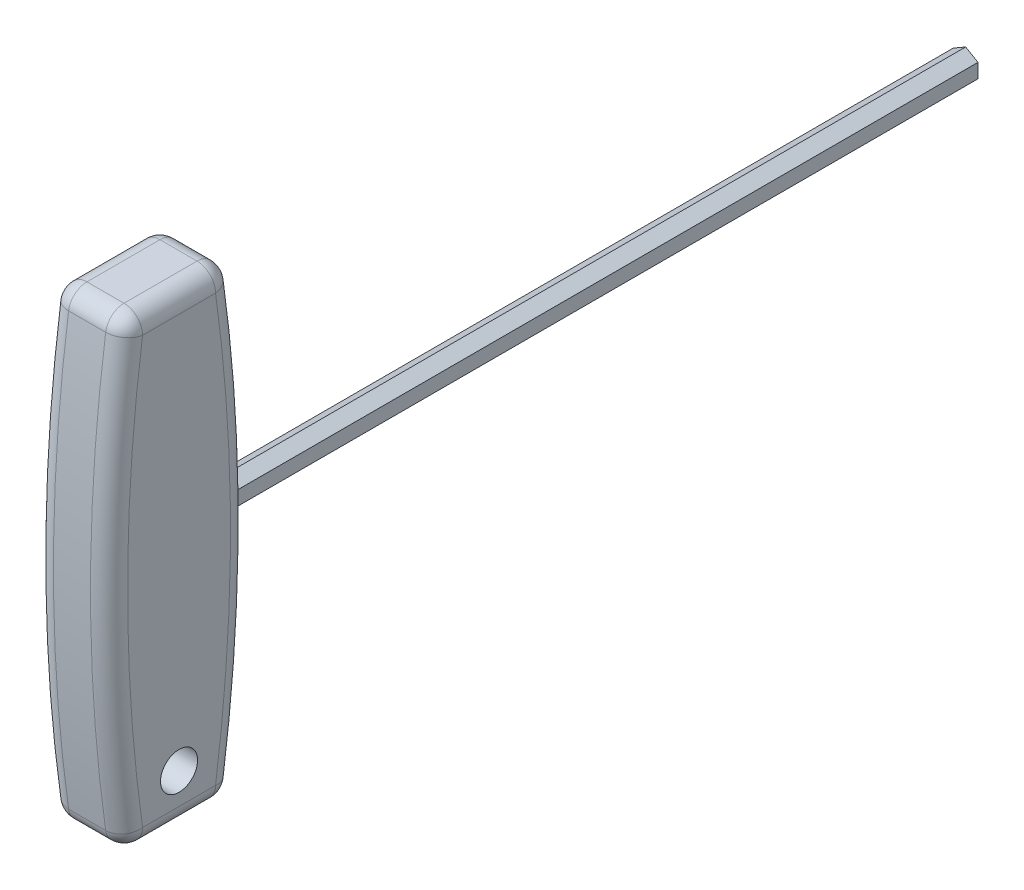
ISO-10303-21;
HEADER;
FILE_DESCRIPTION(('STEP AP214'),'2;1');
FILE_NAME('part.step','',(''),(''),'','','');
FILE_SCHEMA(('AUTOMOTIVE_DESIGN { 1 0 10303 214 1 1 1 1 }'));
ENDSEC;
DATA;
#1=APPLICATION_CONTEXT('core data for automotive mechanical design processes');
#2=APPLICATION_PROTOCOL_DEFINITION('international standard','automotive_design',2000,#1);
#3=PRODUCT_CONTEXT('',#1,'mechanical');
#4=PRODUCT('Part','Part','',(#3));
#5=PRODUCT_RELATED_PRODUCT_CATEGORY('part','',(#4));
#6=PRODUCT_DEFINITION_FORMATION('','',#4);
#7=PRODUCT_DEFINITION_CONTEXT('part definition',#1,'design');
#8=PRODUCT_DEFINITION('design','',#6,#7);
#9=PRODUCT_DEFINITION_SHAPE('','',#8);
#10=(LENGTH_UNIT() NAMED_UNIT(*) SI_UNIT(.MILLI.,.METRE.));
#11=(NAMED_UNIT(*) PLANE_ANGLE_UNIT() SI_UNIT($,.RADIAN.));
#12=(NAMED_UNIT(*) SI_UNIT($,.STERADIAN.) SOLID_ANGLE_UNIT());
#13=UNCERTAINTY_MEASURE_WITH_UNIT(LENGTH_MEASURE(1.E-05),#10,'distance_accuracy_value','');
#14=(GEOMETRIC_REPRESENTATION_CONTEXT(3) GLOBAL_UNCERTAINTY_ASSIGNED_CONTEXT((#13)) GLOBAL_UNIT_ASSIGNED_CONTEXT((#10,
#11,#12)) REPRESENTATION_CONTEXT('',''));
#15=CARTESIAN_POINT('',(0.,0.,0.));
#16=DIRECTION('',(0.,0.,1.));
#17=DIRECTION('',(1.,0.,0.));
#18=AXIS2_PLACEMENT_3D('',#15,#16,#17);
#19=CARTESIAN_POINT('',(0.,0.,0.));
#20=DIRECTION('',(0.,0.,1.));
#21=DIRECTION('',(1.,0.,0.));
#22=AXIS2_PLACEMENT_3D('',#19,#20,#21);
#23=PLANE('',#22);
#24=DIRECTION('',(-0.866025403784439,-0.5,0.));
#25=VECTOR('',#24,1.);
#26=CARTESIAN_POINT('',(-2.,1.15470053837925,0.));
#27=LINE('',#26,#25);
#28=CARTESIAN_POINT('',(0.,2.3094010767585,0.));
#29=VERTEX_POINT('',#28);
#30=CARTESIAN_POINT('',(-2.,1.15470053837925,0.));
#31=VERTEX_POINT('',#30);
#32=EDGE_CURVE('E144',#29,#31,#27,.T.);
#33=ORIENTED_EDGE('',*,*,#32,.F.);
#34=DIRECTION('',(-0.866025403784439,0.5,0.));
#35=VECTOR('',#34,1.);
#36=CARTESIAN_POINT('',(0.,2.3094010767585,0.));
#37=LINE('',#36,#35);
#38=CARTESIAN_POINT('',(2.,1.15470053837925,0.));
#39=VERTEX_POINT('',#38);
#40=EDGE_CURVE('E314',#39,#29,#37,.T.);
#41=ORIENTED_EDGE('',*,*,#40,.F.);
#42=DIRECTION('',(0.,1.,0.));
#43=VECTOR('',#42,1.);
#44=CARTESIAN_POINT('',(2.,1.15470053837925,0.));
#45=LINE('',#44,#43);
#46=CARTESIAN_POINT('',(2.,-1.15470053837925,0.));
#47=VERTEX_POINT('',#46);
#48=EDGE_CURVE('E315',#47,#39,#45,.T.);
#49=ORIENTED_EDGE('',*,*,#48,.F.);
#50=DIRECTION('',(0.866025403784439,0.5,0.));
#51=VECTOR('',#50,1.);
#52=CARTESIAN_POINT('',(2.,-1.15470053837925,0.));
#53=LINE('',#52,#51);
#54=CARTESIAN_POINT('',(0.,-2.3094010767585,0.));
#55=VERTEX_POINT('',#54);
#56=EDGE_CURVE('E320',#55,#47,#53,.T.);
#57=ORIENTED_EDGE('',*,*,#56,.F.);
#58=DIRECTION('',(0.866025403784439,-0.5,0.));
#59=VECTOR('',#58,1.);
#60=CARTESIAN_POINT('',(0.,-2.3094010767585,0.));
#61=LINE('',#60,#59);
#62=CARTESIAN_POINT('',(-2.,-1.15470053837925,0.));
#63=VERTEX_POINT('',#62);
#64=EDGE_CURVE('E324',#63,#55,#61,.T.);
#65=ORIENTED_EDGE('',*,*,#64,.F.);
#66=DIRECTION('',(0.,1.,0.));
#67=VECTOR('',#66,1.);
#68=CARTESIAN_POINT('',(-2.,-1.15470053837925,0.));
#69=LINE('',#68,#67);
#70=EDGE_CURVE('E147',#31,#63,#69,.F.);
#71=ORIENTED_EDGE('',*,*,#70,.F.);
#72=EDGE_LOOP('',(#33,#41,#49,#57,#65,#71));
#73=FACE_BOUND('',#72,.T.);
#74=ADVANCED_FACE('F15',(#73),#23,.F.);
#75=CARTESIAN_POINT('',(-3.,-34.4999999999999,127.410508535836));
#76=DIRECTION('',(1.,0.,0.));
#77=DIRECTION('',(0.,1.,0.));
#78=AXIS2_PLACEMENT_3D('',#75,#76,#77);
#79=SPHERICAL_SURFACE('',#78,3.);
#80=CARTESIAN_POINT('',(-3.,-34.4999999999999,127.410508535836));
#81=DIRECTION('',(-1.,0.,0.));
#82=DIRECTION('',(0.,0.,1.));
#83=AXIS2_PLACEMENT_3D('',#80,#81,#82);
#84=CIRCLE('',#83,3.);
#85=CARTESIAN_POINT('',(-3.,-37.4999999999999,127.410508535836));
#86=VERTEX_POINT('',#85);
#87=CARTESIAN_POINT('',(-3.,-34.9190102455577,124.439914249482));
#88=VERTEX_POINT('',#87);
#89=EDGE_CURVE('E326',#86,#88,#84,.F.);
#90=ORIENTED_EDGE('',*,*,#89,.F.);
#91=CARTESIAN_POINT('',(-3.,-34.4999999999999,127.410508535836));
#92=DIRECTION('',(0.,0.,-1.));
#93=DIRECTION('',(-1.,0.,0.));
#94=AXIS2_PLACEMENT_3D('',#91,#92,#93);
#95=CIRCLE('',#94,3.);
#96=CARTESIAN_POINT('',(-6.,-34.5,127.410508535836));
#97=VERTEX_POINT('',#96);
#98=EDGE_CURVE('E292',#97,#86,#95,.F.);
#99=ORIENTED_EDGE('',*,*,#98,.F.);
#100=CARTESIAN_POINT('',(-3.,-34.5000000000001,127.410508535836));
#101=DIRECTION('',(0.,0.990198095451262,-0.139670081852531));
#102=DIRECTION('',(0.,-0.139670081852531,-0.990198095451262));
#103=AXIS2_PLACEMENT_3D('',#100,#101,#102);
#104=CIRCLE('',#103,3.);
#105=EDGE_CURVE('E258',#88,#97,#104,.T.);
#106=ORIENTED_EDGE('',*,*,#105,.F.);
#107=EDGE_LOOP('',(#90,#99,#106));
#108=FACE_BOUND('',#107,.T.);
#109=ADVANCED_FACE('F356',(#108),#79,.T.);
#110=CARTESIAN_POINT('',(-3.,34.5,127.410508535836));
#111=DIRECTION('',(1.,0.,0.));
#112=DIRECTION('',(0.,1.,0.));
#113=AXIS2_PLACEMENT_3D('',#110,#111,#112);
#114=SPHERICAL_SURFACE('',#113,3.00000000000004);
#115=CARTESIAN_POINT('',(-3.,34.5,127.410508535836));
#116=DIRECTION('',(1.,0.,0.));
#117=DIRECTION('',(0.,0.,-1.));
#118=AXIS2_PLACEMENT_3D('',#115,#116,#117);
#119=CIRCLE('',#118,3.);
#120=CARTESIAN_POINT('',(-3.,34.9190102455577,124.439914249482));
#121=VERTEX_POINT('',#120);
#122=CARTESIAN_POINT('',(-3.,37.5000000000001,127.410508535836));
#123=VERTEX_POINT('',#122);
#124=EDGE_CURVE('E300',#121,#123,#119,.T.);
#125=ORIENTED_EDGE('',*,*,#124,.F.);
#126=CARTESIAN_POINT('',(-3.,34.5000000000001,127.410508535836));
#127=DIRECTION('',(0.,0.990198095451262,0.13967008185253));
#128=DIRECTION('',(0.,0.13967008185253,-0.990198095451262));
#129=AXIS2_PLACEMENT_3D('',#126,#127,#128);
#130=CIRCLE('',#129,3.);
#131=CARTESIAN_POINT('',(-6.,34.5000000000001,127.410508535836));
#132=VERTEX_POINT('',#131);
#133=EDGE_CURVE('E282',#132,#121,#130,.F.);
#134=ORIENTED_EDGE('',*,*,#133,.F.);
#135=CARTESIAN_POINT('',(-3.,34.5000000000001,127.410508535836));
#136=DIRECTION('',(0.,0.,1.));
#137=DIRECTION('',(1.,0.,0.));
#138=AXIS2_PLACEMENT_3D('',#135,#136,#137);
#139=CIRCLE('',#138,3.);
#140=EDGE_CURVE('E248',#123,#132,#139,.T.);
#141=ORIENTED_EDGE('',*,*,#140,.F.);
#142=EDGE_LOOP('',(#125,#134,#141));
#143=FACE_BOUND('',#142,.T.);
#144=ADVANCED_FACE('F353',(#143),#114,.T.);
#145=CARTESIAN_POINT('',(-3.,-34.4999999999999,139.224916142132));
#146=DIRECTION('',(1.,0.,0.));
#147=DIRECTION('',(0.,1.,0.));
#148=AXIS2_PLACEMENT_3D('',#145,#146,#147);
#149=SPHERICAL_SURFACE('',#148,3.00000000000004);
#150=CARTESIAN_POINT('',(-3.,-34.4999999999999,139.224916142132));
#151=DIRECTION('',(1.,0.,0.));
#152=DIRECTION('',(0.,0.,-1.));
#153=AXIS2_PLACEMENT_3D('',#150,#151,#152);
#154=CIRCLE('',#153,3.);
#155=CARTESIAN_POINT('',(-3.,-34.9190102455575,142.195510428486));
#156=VERTEX_POINT('',#155);
#157=CARTESIAN_POINT('',(-3.,-37.4999999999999,139.224916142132));
#158=VERTEX_POINT('',#157);
#159=EDGE_CURVE('E329',#156,#158,#154,.T.);
#160=ORIENTED_EDGE('',*,*,#159,.F.);
#161=CARTESIAN_POINT('',(-3.,-34.4999999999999,139.224916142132));
#162=DIRECTION('',(0.,-0.990198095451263,-0.13967008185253));
#163=DIRECTION('',(0.,-0.13967008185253,0.990198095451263));
#164=AXIS2_PLACEMENT_3D('',#161,#162,#163);
#165=CIRCLE('',#164,3.);
#166=CARTESIAN_POINT('',(-6.,-34.4999999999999,139.224916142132));
#167=VERTEX_POINT('',#166);
#168=EDGE_CURVE('E243',#167,#156,#165,.F.);
#169=ORIENTED_EDGE('',*,*,#168,.F.);
#170=CARTESIAN_POINT('',(-3.,-34.4999999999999,139.224916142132));
#171=DIRECTION('',(0.,0.,-1.));
#172=DIRECTION('',(-1.,0.,0.));
#173=AXIS2_PLACEMENT_3D('',#170,#171,#172);
#174=CIRCLE('',#173,3.);
#175=EDGE_CURVE('E287',#158,#167,#174,.T.);
#176=ORIENTED_EDGE('',*,*,#175,.F.);
#177=EDGE_LOOP('',(#160,#169,#176));
#178=FACE_BOUND('',#177,.T.);
#179=ADVANCED_FACE('F348',(#178),#149,.T.);
#180=CARTESIAN_POINT('',(-3.,34.5000000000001,139.224916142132));
#181=DIRECTION('',(1.,0.,0.));
#182=DIRECTION('',(0.,1.,0.));
#183=AXIS2_PLACEMENT_3D('',#180,#181,#182);
#184=SPHERICAL_SURFACE('',#183,3.);
#185=CARTESIAN_POINT('',(-3.,34.5000000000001,139.224916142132));
#186=DIRECTION('',(1.,0.,0.));
#187=DIRECTION('',(0.,0.,-1.));
#188=AXIS2_PLACEMENT_3D('',#185,#186,#187);
#189=CIRCLE('',#188,3.);
#190=CARTESIAN_POINT('',(-3.,37.5000000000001,139.224916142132));
#191=VERTEX_POINT('',#190);
#192=CARTESIAN_POINT('',(-3.,34.9190102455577,142.195510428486));
#193=VERTEX_POINT('',#192);
#194=EDGE_CURVE('E297',#191,#193,#189,.T.);
#195=ORIENTED_EDGE('',*,*,#194,.F.);
#196=CARTESIAN_POINT('',(-3.,34.5000000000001,139.224916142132));
#197=DIRECTION('',(0.,0.,1.));
#198=DIRECTION('',(1.,0.,0.));
#199=AXIS2_PLACEMENT_3D('',#196,#197,#198);
#200=CIRCLE('',#199,3.);
#201=CARTESIAN_POINT('',(-6.,34.5000000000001,139.224916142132));
#202=VERTEX_POINT('',#201);
#203=EDGE_CURVE('E253',#202,#191,#200,.F.);
#204=ORIENTED_EDGE('',*,*,#203,.F.);
#205=CARTESIAN_POINT('',(-3.,34.5000000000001,139.224916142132));
#206=DIRECTION('',(0.,-0.990198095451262,0.13967008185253));
#207=DIRECTION('',(0.,0.13967008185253,0.990198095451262));
#208=AXIS2_PLACEMENT_3D('',#205,#206,#207);
#209=CIRCLE('',#208,3.);
#210=EDGE_CURVE('E221',#193,#202,#209,.T.);
#211=ORIENTED_EDGE('',*,*,#210,.F.);
#212=EDGE_LOOP('',(#195,#204,#211));
#213=FACE_BOUND('',#212,.T.);
#214=ADVANCED_FACE('F343',(#213),#184,.T.);
#215=CARTESIAN_POINT('',(0.,-34.4999999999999,139.224916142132));
#216=DIRECTION('',(1.,0.,0.));
#217=DIRECTION('',(0.,0.,-1.));
#218=AXIS2_PLACEMENT_3D('',#215,#216,#217);
#219=CYLINDRICAL_SURFACE('',#218,3.);
#220=ORIENTED_EDGE('',*,*,#159,.T.);
#221=DIRECTION('',(1.,0.,0.));
#222=VECTOR('',#221,1.);
#223=CARTESIAN_POINT('',(0.,-37.4999999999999,139.224916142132));
#224=LINE('',#223,#222);
#225=CARTESIAN_POINT('',(3.,-37.4999999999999,139.224916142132));
#226=VERTEX_POINT('',#225);
#227=EDGE_CURVE('E204',#226,#158,#224,.F.);
#228=ORIENTED_EDGE('',*,*,#227,.F.);
#229=CARTESIAN_POINT('',(3.,-34.4999999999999,139.224916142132));
#230=DIRECTION('',(1.,0.,0.));
#231=DIRECTION('',(0.,1.,0.));
#232=AXIS2_PLACEMENT_3D('',#229,#230,#231);
#233=CIRCLE('',#232,3.);
#234=CARTESIAN_POINT('',(3.,-34.9190102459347,142.195510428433));
#235=VERTEX_POINT('',#234);
#236=EDGE_CURVE('E206',#235,#226,#233,.T.);
#237=ORIENTED_EDGE('',*,*,#236,.F.);
#238=DIRECTION('',(1.,0.,0.));
#239=VECTOR('',#238,1.);
#240=CARTESIAN_POINT('',(0.,-34.9190102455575,142.195510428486));
#241=LINE('',#240,#239);
#242=EDGE_CURVE('E209',#156,#235,#241,.T.);
#243=ORIENTED_EDGE('',*,*,#242,.F.);
#244=EDGE_LOOP('',(#220,#228,#237,#243));
#245=FACE_BOUND('',#244,.T.);
#246=ADVANCED_FACE('F347',(#245),#219,.T.);
#247=CARTESIAN_POINT('',(0.,-34.4999999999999,127.410508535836));
#248=DIRECTION('',(-1.,0.,0.));
#249=DIRECTION('',(0.,0.,1.));
#250=AXIS2_PLACEMENT_3D('',#247,#248,#249);
#251=CYLINDRICAL_SURFACE('',#250,3.);
#252=CARTESIAN_POINT('',(3.,-34.4999999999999,127.410508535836));
#253=DIRECTION('',(1.,0.,0.));
#254=DIRECTION('',(0.,1.,0.));
#255=AXIS2_PLACEMENT_3D('',#252,#253,#254);
#256=CIRCLE('',#255,3.);
#257=CARTESIAN_POINT('',(3.,-37.4999999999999,127.410508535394));
#258=VERTEX_POINT('',#257);
#259=CARTESIAN_POINT('',(3.,-34.9190102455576,124.439914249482));
#260=VERTEX_POINT('',#259);
#261=EDGE_CURVE('E179',#258,#260,#256,.T.);
#262=ORIENTED_EDGE('',*,*,#261,.F.);
#263=DIRECTION('',(1.,0.,0.));
#264=VECTOR('',#263,1.);
#265=CARTESIAN_POINT('',(0.,-37.4999999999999,127.410508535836));
#266=LINE('',#265,#264);
#267=EDGE_CURVE('E333',#86,#258,#266,.T.);
#268=ORIENTED_EDGE('',*,*,#267,.F.);
#269=ORIENTED_EDGE('',*,*,#89,.T.);
#270=DIRECTION('',(1.,0.,0.));
#271=VECTOR('',#270,1.);
#272=CARTESIAN_POINT('',(0.,-34.9190102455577,124.439914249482));
#273=LINE('',#272,#271);
#274=EDGE_CURVE('E171',#260,#88,#273,.F.);
#275=ORIENTED_EDGE('',*,*,#274,.F.);
#276=EDGE_LOOP('',(#262,#268,#269,#275));
#277=FACE_BOUND('',#276,.T.);
#278=ADVANCED_FACE('F596',(#277),#251,.T.);
#279=CARTESIAN_POINT('',(-2.,1.15470053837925,0.));
#280=DIRECTION('',(-0.5,0.866025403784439,0.));
#281=DIRECTION('',(-0.866025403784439,-0.5,0.));
#282=AXIS2_PLACEMENT_3D('',#279,#280,#281);
#283=PLANE('',#282);
#284=ORIENTED_EDGE('',*,*,#32,.T.);
#285=DIRECTION('',(0.,0.,1.));
#286=VECTOR('',#285,1.);
#287=CARTESIAN_POINT('',(-2.,1.15470053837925,0.));
#288=LINE('',#287,#286);
#289=CARTESIAN_POINT('',(-2.,1.15470053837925,121.992000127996));
#290=VERTEX_POINT('',#289);
#291=EDGE_CURVE('E141',#290,#31,#288,.F.);
#292=ORIENTED_EDGE('',*,*,#291,.F.);
#293=CARTESIAN_POINT('',(-4.,0.,372.));
#294=DIRECTION('',(-0.5,0.866025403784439,0.));
#295=DIRECTION('',(0.866025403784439,0.5,0.));
#296=AXIS2_PLACEMENT_3D('',#293,#294,#295);
#297=ELLIPSE('',#296,500.021332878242,250.010666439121);
#298=CARTESIAN_POINT('',(0.,2.3094010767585,122.));
#299=VERTEX_POINT('',#298);
#300=EDGE_CURVE('E18',#299,#290,#297,.T.);
#301=ORIENTED_EDGE('',*,*,#300,.F.);
#302=DIRECTION('',(0.,0.,1.));
#303=VECTOR('',#302,1.);
#304=CARTESIAN_POINT('',(0.,2.3094010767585,0.));
#305=LINE('',#304,#303);
#306=EDGE_CURVE('E303',#29,#299,#305,.T.);
#307=ORIENTED_EDGE('',*,*,#306,.F.);
#308=EDGE_LOOP('',(#284,#292,#301,#307));
#309=FACE_BOUND('',#308,.T.);
#310=ADVANCED_FACE('F143',(#309),#283,.T.);
#311=CARTESIAN_POINT('',(-2.,-1.15470053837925,0.));
#312=DIRECTION('',(-1.,0.,0.));
#313=DIRECTION('',(0.,0.,1.));
#314=AXIS2_PLACEMENT_3D('',#311,#312,#313);
#315=PLANE('',#314);
#316=ORIENTED_EDGE('',*,*,#70,.T.);
#317=DIRECTION('',(0.,0.,1.));
#318=VECTOR('',#317,1.);
#319=CARTESIAN_POINT('',(-2.,-1.15470053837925,0.));
#320=LINE('',#319,#318);
#321=CARTESIAN_POINT('',(-2.,-1.15470053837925,121.992000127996));
#322=VERTEX_POINT('',#321);
#323=EDGE_CURVE('E153',#322,#63,#320,.F.);
#324=ORIENTED_EDGE('',*,*,#323,.F.);
#325=CARTESIAN_POINT('',(-2.,0.,372.));
#326=DIRECTION('',(1.,0.,0.));
#327=DIRECTION('',(0.,0.,-1.));
#328=AXIS2_PLACEMENT_3D('',#325,#326,#327);
#329=CIRCLE('',#328,250.010666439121);
#330=EDGE_CURVE('E150',#290,#322,#329,.F.);
#331=ORIENTED_EDGE('',*,*,#330,.F.);
#332=ORIENTED_EDGE('',*,*,#291,.T.);
#333=EDGE_LOOP('',(#316,#324,#331,#332));
#334=FACE_BOUND('',#333,.T.);
#335=ADVANCED_FACE('F151',(#334),#315,.T.);
#336=CARTESIAN_POINT('',(0.,-2.3094010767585,0.));
#337=DIRECTION('',(-0.5,-0.866025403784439,0.));
#338=DIRECTION('',(0.866025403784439,-0.5,0.));
#339=AXIS2_PLACEMENT_3D('',#336,#337,#338);
#340=PLANE('',#339);
#341=ORIENTED_EDGE('',*,*,#64,.T.);
#342=DIRECTION('',(0.,0.,1.));
#343=VECTOR('',#342,1.);
#344=CARTESIAN_POINT('',(0.,-2.3094010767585,0.));
#345=LINE('',#344,#343);
#346=CARTESIAN_POINT('',(0.,-2.3094010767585,122.));
#347=VERTEX_POINT('',#346);
#348=EDGE_CURVE('E321',#347,#55,#345,.F.);
#349=ORIENTED_EDGE('',*,*,#348,.F.);
#350=CARTESIAN_POINT('',(-4.,0.,372.));
#351=DIRECTION('',(-0.5,-0.866025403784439,0.));
#352=DIRECTION('',(0.866025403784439,-0.5,0.));
#353=AXIS2_PLACEMENT_3D('',#350,#351,#352);
#354=ELLIPSE('',#353,500.021332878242,250.010666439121);
#355=EDGE_CURVE('E157',#322,#347,#354,.T.);
#356=ORIENTED_EDGE('',*,*,#355,.F.);
#357=ORIENTED_EDGE('',*,*,#323,.T.);
#358=EDGE_LOOP('',(#341,#349,#356,#357));
#359=FACE_BOUND('',#358,.T.);
#360=ADVANCED_FACE('F383',(#359),#340,.T.);
#361=CARTESIAN_POINT('',(2.,-1.15470053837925,0.));
#362=DIRECTION('',(0.5,-0.866025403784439,0.));
#363=DIRECTION('',(0.866025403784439,0.5,0.));
#364=AXIS2_PLACEMENT_3D('',#361,#362,#363);
#365=PLANE('',#364);
#366=ORIENTED_EDGE('',*,*,#56,.T.);
#367=DIRECTION('',(0.,0.,-1.));
#368=VECTOR('',#367,1.);
#369=CARTESIAN_POINT('',(2.,-1.15470053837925,0.));
#370=LINE('',#369,#368);
#371=CARTESIAN_POINT('',(2.,-1.15470053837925,121.992000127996));
#372=VERTEX_POINT('',#371);
#373=EDGE_CURVE('E317',#372,#47,#370,.T.);
#374=ORIENTED_EDGE('',*,*,#373,.F.);
#375=CARTESIAN_POINT('',(4.,0.,372.));
#376=DIRECTION('',(0.5,-0.866025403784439,0.));
#377=DIRECTION('',(0.866025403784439,0.5,0.));
#378=AXIS2_PLACEMENT_3D('',#375,#376,#377);
#379=ELLIPSE('',#378,500.021332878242,250.010666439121);
#380=EDGE_CURVE('E378',#347,#372,#379,.T.);
#381=ORIENTED_EDGE('',*,*,#380,.F.);
#382=ORIENTED_EDGE('',*,*,#348,.T.);
#383=EDGE_LOOP('',(#366,#374,#381,#382));
#384=FACE_BOUND('',#383,.T.);
#385=ADVANCED_FACE('F387',(#384),#365,.T.);
#386=CARTESIAN_POINT('',(2.,1.15470053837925,0.));
#387=DIRECTION('',(1.,0.,0.));
#388=DIRECTION('',(0.,0.,-1.));
#389=AXIS2_PLACEMENT_3D('',#386,#387,#388);
#390=PLANE('',#389);
#391=ORIENTED_EDGE('',*,*,#48,.T.);
#392=DIRECTION('',(0.,0.,1.));
#393=VECTOR('',#392,1.);
#394=CARTESIAN_POINT('',(2.,1.15470053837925,0.));
#395=LINE('',#394,#393);
#396=CARTESIAN_POINT('',(2.,1.15470053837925,121.992000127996));
#397=VERTEX_POINT('',#396);
#398=EDGE_CURVE('E311',#397,#39,#395,.F.);
#399=ORIENTED_EDGE('',*,*,#398,.F.);
#400=CARTESIAN_POINT('',(2.,0.,372.));
#401=DIRECTION('',(1.,0.,0.));
#402=DIRECTION('',(0.,0.,-1.));
#403=AXIS2_PLACEMENT_3D('',#400,#401,#402);
#404=CIRCLE('',#403,250.010666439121);
#405=EDGE_CURVE('E376',#372,#397,#404,.T.);
#406=ORIENTED_EDGE('',*,*,#405,.F.);
#407=ORIENTED_EDGE('',*,*,#373,.T.);
#408=EDGE_LOOP('',(#391,#399,#406,#407));
#409=FACE_BOUND('',#408,.T.);
#410=ADVANCED_FACE('F391',(#409),#390,.T.);
#411=CARTESIAN_POINT('',(0.,2.3094010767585,0.));
#412=DIRECTION('',(0.5,0.866025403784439,0.));
#413=DIRECTION('',(-0.866025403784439,0.5,0.));
#414=AXIS2_PLACEMENT_3D('',#411,#412,#413);
#415=PLANE('',#414);
#416=ORIENTED_EDGE('',*,*,#40,.T.);
#417=ORIENTED_EDGE('',*,*,#306,.T.);
#418=CARTESIAN_POINT('',(4.,0.,372.));
#419=DIRECTION('',(0.5,0.866025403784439,0.));
#420=DIRECTION('',(0.866025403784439,-0.5,0.));
#421=AXIS2_PLACEMENT_3D('',#418,#419,#420);
#422=ELLIPSE('',#421,500.021332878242,250.010666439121);
#423=EDGE_CURVE('E163',#397,#299,#422,.T.);
#424=ORIENTED_EDGE('',*,*,#423,.F.);
#425=ORIENTED_EDGE('',*,*,#398,.T.);
#426=EDGE_LOOP('',(#416,#417,#424,#425));
#427=FACE_BOUND('',#426,.T.);
#428=ADVANCED_FACE('F394',(#427),#415,.T.);
#429=CARTESIAN_POINT('',(0.,34.5,127.410508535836));
#430=DIRECTION('',(1.,0.,0.));
#431=DIRECTION('',(0.,0.,-1.));
#432=AXIS2_PLACEMENT_3D('',#429,#430,#431);
#433=CYLINDRICAL_SURFACE('',#432,3.);
#434=ORIENTED_EDGE('',*,*,#124,.T.);
#435=DIRECTION('',(1.,0.,0.));
#436=VECTOR('',#435,1.);
#437=CARTESIAN_POINT('',(0.,37.5000000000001,127.410508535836));
#438=LINE('',#437,#436);
#439=CARTESIAN_POINT('',(3.,37.5000000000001,127.410508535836));
#440=VERTEX_POINT('',#439);
#441=EDGE_CURVE('E308',#440,#123,#438,.F.);
#442=ORIENTED_EDGE('',*,*,#441,.F.);
#443=CARTESIAN_POINT('',(3.,34.5,127.410508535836));
#444=DIRECTION('',(1.,0.,0.));
#445=DIRECTION('',(0.,1.,0.));
#446=AXIS2_PLACEMENT_3D('',#443,#444,#445);
#447=CIRCLE('',#446,3.);
#448=CARTESIAN_POINT('',(3.,34.9190102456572,124.439914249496));
#449=VERTEX_POINT('',#448);
#450=EDGE_CURVE('E375',#449,#440,#447,.T.);
#451=ORIENTED_EDGE('',*,*,#450,.F.);
#452=DIRECTION('',(1.,0.,0.));
#453=VECTOR('',#452,1.);
#454=CARTESIAN_POINT('',(0.,34.9190102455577,124.439914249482));
#455=LINE('',#454,#453);
#456=EDGE_CURVE('E164',#121,#449,#455,.T.);
#457=ORIENTED_EDGE('',*,*,#456,.F.);
#458=EDGE_LOOP('',(#434,#442,#451,#457));
#459=FACE_BOUND('',#458,.T.);
#460=ADVANCED_FACE('F580',(#459),#433,.T.);
#461=CARTESIAN_POINT('',(0.,34.5000000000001,139.224916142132));
#462=DIRECTION('',(1.,0.,0.));
#463=DIRECTION('',(0.,0.,-1.));
#464=AXIS2_PLACEMENT_3D('',#461,#462,#463);
#465=CYLINDRICAL_SURFACE('',#464,3.);
#466=ORIENTED_EDGE('',*,*,#194,.T.);
#467=DIRECTION('',(1.,0.,0.));
#468=VECTOR('',#467,1.);
#469=CARTESIAN_POINT('',(0.,34.9190102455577,142.195510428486));
#470=LINE('',#469,#468);
#471=CARTESIAN_POINT('',(3.,34.9190102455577,142.195510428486));
#472=VERTEX_POINT('',#471);
#473=EDGE_CURVE('E218',#472,#193,#470,.F.);
#474=ORIENTED_EDGE('',*,*,#473,.F.);
#475=CARTESIAN_POINT('',(3.,34.5000000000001,139.224916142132));
#476=DIRECTION('',(1.,0.,0.));
#477=DIRECTION('',(0.,1.,0.));
#478=AXIS2_PLACEMENT_3D('',#475,#476,#477);
#479=CIRCLE('',#478,3.);
#480=CARTESIAN_POINT('',(3.,37.5000000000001,139.224916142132));
#481=VERTEX_POINT('',#480);
#482=EDGE_CURVE('E307',#481,#472,#479,.T.);
#483=ORIENTED_EDGE('',*,*,#482,.F.);
#484=DIRECTION('',(1.,0.,0.));
#485=VECTOR('',#484,1.);
#486=CARTESIAN_POINT('',(0.,37.5000000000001,139.224916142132));
#487=LINE('',#486,#485);
#488=EDGE_CURVE('E569',#191,#481,#487,.T.);
#489=ORIENTED_EDGE('',*,*,#488,.F.);
#490=EDGE_LOOP('',(#466,#474,#483,#489));
#491=FACE_BOUND('',#490,.T.);
#492=ADVANCED_FACE('F584',(#491),#465,.T.);
#493=CARTESIAN_POINT('',(-3.,-34.4999999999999,129.067712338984));
#494=DIRECTION('',(0.,0.,-1.));
#495=DIRECTION('',(-1.,0.,0.));
#496=AXIS2_PLACEMENT_3D('',#493,#494,#495);
#497=CYLINDRICAL_SURFACE('',#496,3.);
#498=ORIENTED_EDGE('',*,*,#175,.T.);
#499=DIRECTION('',(0.,0.,-1.));
#500=VECTOR('',#499,1.);
#501=CARTESIAN_POINT('',(-6.,-34.4999999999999,133.317712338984));
#502=LINE('',#501,#500);
#503=EDGE_CURVE('E548',#167,#97,#502,.T.);
#504=ORIENTED_EDGE('',*,*,#503,.T.);
#505=ORIENTED_EDGE('',*,*,#98,.T.);
#506=DIRECTION('',(0.,0.,-1.));
#507=VECTOR('',#506,1.);
#508=CARTESIAN_POINT('',(-3.,-37.4999999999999,124.817712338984));
#509=LINE('',#508,#507);
#510=EDGE_CURVE('E330',#158,#86,#509,.T.);
#511=ORIENTED_EDGE('',*,*,#510,.F.);
#512=EDGE_LOOP('',(#498,#504,#505,#511));
#513=FACE_BOUND('',#512,.T.);
#514=ADVANCED_FACE('F269',(#513),#497,.T.);
#515=CARTESIAN_POINT('',(-3.,0.,372.));
#516=DIRECTION('',(1.,0.,0.));
#517=DIRECTION('',(0.,0.,-1.));
#518=AXIS2_PLACEMENT_3D('',#515,#516,#517);
#519=TOROIDAL_SURFACE('',#518,247.010666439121,3.);
#520=ORIENTED_EDGE('',*,*,#105,.T.);
#521=CARTESIAN_POINT('',(-6.,0.,372.));
#522=DIRECTION('',(1.,0.,0.));
#523=DIRECTION('',(0.,-0.139670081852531,-0.990198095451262));
#524=AXIS2_PLACEMENT_3D('',#521,#522,#523);
#525=CIRCLE('',#524,247.010666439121);
#526=EDGE_CURVE('E524',#97,#132,#525,.T.);
#527=ORIENTED_EDGE('',*,*,#526,.T.);
#528=ORIENTED_EDGE('',*,*,#133,.T.);
#529=CARTESIAN_POINT('',(-3.,0.,372.));
#530=DIRECTION('',(1.,0.,0.));
#531=DIRECTION('',(0.,0.,-1.));
#532=AXIS2_PLACEMENT_3D('',#529,#530,#531);
#533=CIRCLE('',#532,250.010666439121);
#534=EDGE_CURVE('E166',#88,#121,#533,.T.);
#535=ORIENTED_EDGE('',*,*,#534,.F.);
#536=EDGE_LOOP('',(#520,#527,#528,#535));
#537=FACE_BOUND('',#536,.T.);
#538=ADVANCED_FACE('F265',(#537),#519,.T.);
#539=CARTESIAN_POINT('',(-3.,34.5000000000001,137.567712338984));
#540=DIRECTION('',(0.,0.,1.));
#541=DIRECTION('',(1.,0.,0.));
#542=AXIS2_PLACEMENT_3D('',#539,#540,#541);
#543=CYLINDRICAL_SURFACE('',#542,3.);
#544=ORIENTED_EDGE('',*,*,#140,.T.);
#545=DIRECTION('',(0.,0.,-1.));
#546=VECTOR('',#545,1.);
#547=CARTESIAN_POINT('',(-6.,34.5000000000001,133.317712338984));
#548=LINE('',#547,#546);
#549=EDGE_CURVE('E538',#132,#202,#548,.F.);
#550=ORIENTED_EDGE('',*,*,#549,.T.);
#551=ORIENTED_EDGE('',*,*,#203,.T.);
#552=DIRECTION('',(0.,0.,1.));
#553=VECTOR('',#552,1.);
#554=CARTESIAN_POINT('',(-3.,37.5000000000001,141.817712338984));
#555=LINE('',#554,#553);
#556=EDGE_CURVE('E304',#123,#191,#555,.T.);
#557=ORIENTED_EDGE('',*,*,#556,.F.);
#558=EDGE_LOOP('',(#544,#550,#551,#557));
#559=FACE_BOUND('',#558,.T.);
#560=ADVANCED_FACE('F230',(#559),#543,.T.);
#561=CARTESIAN_POINT('',(-3.,0.,-105.364575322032));
#562=DIRECTION('',(1.,0.,0.));
#563=DIRECTION('',(0.,0.,-1.));
#564=AXIS2_PLACEMENT_3D('',#561,#562,#563);
#565=TOROIDAL_SURFACE('',#564,247.010666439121,3.);
#566=ORIENTED_EDGE('',*,*,#210,.T.);
#567=CARTESIAN_POINT('',(-6.,0.,-105.364575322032));
#568=DIRECTION('',(1.,0.,0.));
#569=DIRECTION('',(0.,0.13967008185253,0.990198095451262));
#570=AXIS2_PLACEMENT_3D('',#567,#568,#569);
#571=CIRCLE('',#570,247.010666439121);
#572=EDGE_CURVE('E516',#202,#167,#571,.T.);
#573=ORIENTED_EDGE('',*,*,#572,.T.);
#574=ORIENTED_EDGE('',*,*,#168,.T.);
#575=CARTESIAN_POINT('',(-3.,0.,-105.364575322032));
#576=DIRECTION('',(1.,0.,0.));
#577=DIRECTION('',(0.,0.,-1.));
#578=AXIS2_PLACEMENT_3D('',#575,#576,#577);
#579=CIRCLE('',#578,250.010666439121);
#580=EDGE_CURVE('E217',#193,#156,#579,.T.);
#581=ORIENTED_EDGE('',*,*,#580,.F.);
#582=EDGE_LOOP('',(#566,#573,#574,#581));
#583=FACE_BOUND('',#582,.T.);
#584=ADVANCED_FACE('F226',(#583),#565,.T.);
#585=CARTESIAN_POINT('',(0.,0.,-105.364575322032));
#586=DIRECTION('',(1.,0.,0.));
#587=DIRECTION('',(0.,0.,-1.));
#588=AXIS2_PLACEMENT_3D('',#585,#586,#587);
#589=CYLINDRICAL_SURFACE('',#588,250.010666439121);
#590=ORIENTED_EDGE('',*,*,#580,.T.);
#591=ORIENTED_EDGE('',*,*,#242,.T.);
#592=CARTESIAN_POINT('',(3.,0.,-105.364575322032));
#593=DIRECTION('',(-1.,0.,0.));
#594=DIRECTION('',(0.,0.,1.));
#595=AXIS2_PLACEMENT_3D('',#592,#593,#594);
#596=CIRCLE('',#595,250.010666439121);
#597=EDGE_CURVE('E210',#472,#235,#596,.F.);
#598=ORIENTED_EDGE('',*,*,#597,.F.);
#599=ORIENTED_EDGE('',*,*,#473,.T.);
#600=EDGE_LOOP('',(#590,#591,#598,#599));
#601=FACE_BOUND('',#600,.T.);
#602=ADVANCED_FACE('F198',(#601),#589,.T.);
#603=CARTESIAN_POINT('',(3.,-34.4999999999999,139.224916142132));
#604=DIRECTION('',(1.,0.,0.));
#605=DIRECTION('',(0.,1.,0.));
#606=AXIS2_PLACEMENT_3D('',#603,#604,#605);
#607=SPHERICAL_SURFACE('',#606,3.);
#608=CARTESIAN_POINT('',(3.,-34.5000000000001,139.224916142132));
#609=DIRECTION('',(0.,0.990198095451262,0.139670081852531));
#610=DIRECTION('',(0.,-0.139670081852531,0.990198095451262));
#611=AXIS2_PLACEMENT_3D('',#608,#609,#610);
#612=CIRCLE('',#611,3.);
#613=CARTESIAN_POINT('',(6.,-34.5,139.224916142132));
#614=VERTEX_POINT('',#613);
#615=EDGE_CURVE('E213',#235,#614,#612,.T.);
#616=ORIENTED_EDGE('',*,*,#615,.F.);
#617=ORIENTED_EDGE('',*,*,#236,.T.);
#618=CARTESIAN_POINT('',(3.,-34.4999999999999,139.224916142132));
#619=DIRECTION('',(0.,0.,1.));
#620=DIRECTION('',(1.,0.,0.));
#621=AXIS2_PLACEMENT_3D('',#618,#619,#620);
#622=CIRCLE('',#621,3.);
#623=EDGE_CURVE('E480',#614,#226,#622,.F.);
#624=ORIENTED_EDGE('',*,*,#623,.F.);
#625=EDGE_LOOP('',(#616,#617,#624));
#626=FACE_BOUND('',#625,.T.);
#627=ADVANCED_FACE('F193',(#626),#607,.T.);
#628=CARTESIAN_POINT('',(0.,-37.4999999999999,124.817712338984));
#629=DIRECTION('',(0.,-1.,0.));
#630=DIRECTION('',(0.,0.,-1.));
#631=AXIS2_PLACEMENT_3D('',#628,#629,#630);
#632=PLANE('',#631);
#633=ORIENTED_EDGE('',*,*,#267,.T.);
#634=DIRECTION('',(0.,0.,1.));
#635=VECTOR('',#634,1.);
#636=CARTESIAN_POINT('',(3.,-37.4999999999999,129.067712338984));
#637=LINE('',#636,#635);
#638=EDGE_CURVE('E483',#226,#258,#637,.F.);
#639=ORIENTED_EDGE('',*,*,#638,.F.);
#640=ORIENTED_EDGE('',*,*,#227,.T.);
#641=ORIENTED_EDGE('',*,*,#510,.T.);
#642=EDGE_LOOP('',(#633,#639,#640,#641));
#643=FACE_BOUND('',#642,.T.);
#644=ADVANCED_FACE('F188',(#643),#632,.T.);
#645=CARTESIAN_POINT('',(3.,-34.4999999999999,127.410508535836));
#646=DIRECTION('',(1.,0.,0.));
#647=DIRECTION('',(0.,1.,0.));
#648=AXIS2_PLACEMENT_3D('',#645,#646,#647);
#649=SPHERICAL_SURFACE('',#648,3.);
#650=CARTESIAN_POINT('',(3.,-34.4999999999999,127.410508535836));
#651=DIRECTION('',(0.,0.,1.));
#652=DIRECTION('',(1.,0.,0.));
#653=AXIS2_PLACEMENT_3D('',#650,#651,#652);
#654=CIRCLE('',#653,3.);
#655=CARTESIAN_POINT('',(6.,-34.4999999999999,127.410508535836));
#656=VERTEX_POINT('',#655);
#657=EDGE_CURVE('E477',#258,#656,#654,.T.);
#658=ORIENTED_EDGE('',*,*,#657,.F.);
#659=ORIENTED_EDGE('',*,*,#261,.T.);
#660=CARTESIAN_POINT('',(3.,-34.4999999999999,127.410508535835));
#661=DIRECTION('',(0.,-0.990198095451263,0.13967008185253));
#662=DIRECTION('',(0.,-0.13967008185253,-0.990198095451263));
#663=AXIS2_PLACEMENT_3D('',#660,#661,#662);
#664=CIRCLE('',#663,3.);
#665=EDGE_CURVE('E474',#656,#260,#664,.F.);
#666=ORIENTED_EDGE('',*,*,#665,.F.);
#667=EDGE_LOOP('',(#658,#659,#666));
#668=FACE_BOUND('',#667,.T.);
#669=ADVANCED_FACE('F184',(#668),#649,.T.);
#670=CARTESIAN_POINT('',(0.,0.,372.));
#671=DIRECTION('',(1.,0.,0.));
#672=DIRECTION('',(0.,0.,-1.));
#673=AXIS2_PLACEMENT_3D('',#670,#671,#672);
#674=CYLINDRICAL_SURFACE('',#673,250.010666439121);
#675=ORIENTED_EDGE('',*,*,#405,.T.);
#676=ORIENTED_EDGE('',*,*,#423,.T.);
#677=ORIENTED_EDGE('',*,*,#300,.T.);
#678=ORIENTED_EDGE('',*,*,#330,.T.);
#679=ORIENTED_EDGE('',*,*,#355,.T.);
#680=ORIENTED_EDGE('',*,*,#380,.T.);
#681=EDGE_LOOP('',(#675,#676,#677,#678,#679,#680));
#682=FACE_BOUND('',#681,.T.);
#683=ORIENTED_EDGE('',*,*,#456,.T.);
#684=CARTESIAN_POINT('',(3.,0.,372.));
#685=DIRECTION('',(-1.,0.,0.));
#686=DIRECTION('',(0.,0.,1.));
#687=AXIS2_PLACEMENT_3D('',#684,#685,#686);
#688=CIRCLE('',#687,250.010666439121);
#689=EDGE_CURVE('E175',#260,#449,#688,.F.);
#690=ORIENTED_EDGE('',*,*,#689,.F.);
#691=ORIENTED_EDGE('',*,*,#274,.T.);
#692=ORIENTED_EDGE('',*,*,#534,.T.);
#693=EDGE_LOOP('',(#683,#690,#691,#692));
#694=FACE_BOUND('',#693,.T.);
#695=ADVANCED_FACE('F160',(#682,#694),#674,.T.);
#696=CARTESIAN_POINT('',(3.,34.5,127.410508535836));
#697=DIRECTION('',(1.,0.,0.));
#698=DIRECTION('',(0.,1.,0.));
#699=AXIS2_PLACEMENT_3D('',#696,#697,#698);
#700=SPHERICAL_SURFACE('',#699,3.);
#701=CARTESIAN_POINT('',(3.,34.5000000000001,127.410508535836));
#702=DIRECTION('',(0.,0.,-1.));
#703=DIRECTION('',(-1.,0.,0.));
#704=AXIS2_PLACEMENT_3D('',#701,#702,#703);
#705=CIRCLE('',#704,3.);
#706=CARTESIAN_POINT('',(6.,34.5000000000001,127.410508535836));
#707=VERTEX_POINT('',#706);
#708=EDGE_CURVE('E33',#707,#440,#705,.F.);
#709=ORIENTED_EDGE('',*,*,#708,.F.);
#710=CARTESIAN_POINT('',(3.,34.5000000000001,127.410508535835));
#711=DIRECTION('',(0.,-0.990198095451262,-0.13967008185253));
#712=DIRECTION('',(0.,0.13967008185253,-0.990198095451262));
#713=AXIS2_PLACEMENT_3D('',#710,#711,#712);
#714=CIRCLE('',#713,3.);
#715=EDGE_CURVE('E444',#449,#707,#714,.T.);
#716=ORIENTED_EDGE('',*,*,#715,.F.);
#717=ORIENTED_EDGE('',*,*,#450,.T.);
#718=EDGE_LOOP('',(#709,#716,#717));
#719=FACE_BOUND('',#718,.T.);
#720=ADVANCED_FACE('F562',(#719),#700,.T.);
#721=CARTESIAN_POINT('',(0.,37.5000000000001,141.817712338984));
#722=DIRECTION('',(0.,1.,0.));
#723=DIRECTION('',(0.,0.,1.));
#724=AXIS2_PLACEMENT_3D('',#721,#722,#723);
#725=PLANE('',#724);
#726=ORIENTED_EDGE('',*,*,#441,.T.);
#727=ORIENTED_EDGE('',*,*,#556,.T.);
#728=ORIENTED_EDGE('',*,*,#488,.T.);
#729=DIRECTION('',(0.,0.,-1.));
#730=VECTOR('',#729,1.);
#731=CARTESIAN_POINT('',(3.,37.5000000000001,137.567712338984));
#732=LINE('',#731,#730);
#733=EDGE_CURVE('E443',#440,#481,#732,.F.);
#734=ORIENTED_EDGE('',*,*,#733,.F.);
#735=EDGE_LOOP('',(#726,#727,#728,#734));
#736=FACE_BOUND('',#735,.T.);
#737=ADVANCED_FACE('F559',(#736),#725,.T.);
#738=CARTESIAN_POINT('',(3.,34.5000000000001,139.224916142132));
#739=DIRECTION('',(1.,0.,0.));
#740=DIRECTION('',(0.,1.,0.));
#741=AXIS2_PLACEMENT_3D('',#738,#739,#740);
#742=SPHERICAL_SURFACE('',#741,3.);
#743=CARTESIAN_POINT('',(3.,34.5,139.224916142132));
#744=DIRECTION('',(0.,0.990198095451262,-0.13967008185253));
#745=DIRECTION('',(0.,0.13967008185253,0.990198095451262));
#746=AXIS2_PLACEMENT_3D('',#743,#744,#745);
#747=CIRCLE('',#746,3.);
#748=CARTESIAN_POINT('',(6.,34.5,139.224916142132));
#749=VERTEX_POINT('',#748);
#750=EDGE_CURVE('E214',#749,#472,#747,.F.);
#751=ORIENTED_EDGE('',*,*,#750,.F.);
#752=CARTESIAN_POINT('',(3.,34.5000000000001,139.224916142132));
#753=DIRECTION('',(0.,0.,-1.));
#754=DIRECTION('',(-1.,0.,0.));
#755=AXIS2_PLACEMENT_3D('',#752,#753,#754);
#756=CIRCLE('',#755,3.);
#757=EDGE_CURVE('E373',#481,#749,#756,.T.);
#758=ORIENTED_EDGE('',*,*,#757,.F.);
#759=ORIENTED_EDGE('',*,*,#482,.T.);
#760=EDGE_LOOP('',(#751,#758,#759));
#761=FACE_BOUND('',#760,.T.);
#762=ADVANCED_FACE('F556',(#761),#742,.T.);
#763=CARTESIAN_POINT('',(-6.,0.,133.317712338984));
#764=DIRECTION('',(1.,0.,0.));
#765=DIRECTION('',(0.,0.,-1.));
#766=AXIS2_PLACEMENT_3D('',#763,#764,#765);
#767=PLANE('',#766);
#768=CARTESIAN_POINT('',(-6.,-29.4999999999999,133.317712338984));
#769=DIRECTION('',(1.,0.,0.));
#770=DIRECTION('',(0.,0.,-1.));
#771=AXIS2_PLACEMENT_3D('',#768,#769,#770);
#772=CIRCLE('',#771,3.);
#773=CARTESIAN_POINT('',(-6.,-29.4999999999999,130.317712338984));
#774=VERTEX_POINT('',#773);
#775=EDGE_CURVE('E369',#774,#774,#772,.T.);
#776=ORIENTED_EDGE('',*,*,#775,.T.);
#777=EDGE_LOOP('',(#776));
#778=FACE_BOUND('',#777,.T.);
#779=ORIENTED_EDGE('',*,*,#549,.F.);
#780=ORIENTED_EDGE('',*,*,#526,.F.);
#781=ORIENTED_EDGE('',*,*,#503,.F.);
#782=ORIENTED_EDGE('',*,*,#572,.F.);
#783=EDGE_LOOP('',(#779,#780,#781,#782));
#784=FACE_BOUND('',#783,.T.);
#785=ADVANCED_FACE('F498',(#778,#784),#767,.F.);
#786=CARTESIAN_POINT('',(3.,0.,-105.364575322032));
#787=DIRECTION('',(-1.,0.,0.));
#788=DIRECTION('',(0.,0.,1.));
#789=AXIS2_PLACEMENT_3D('',#786,#787,#788);
#790=TOROIDAL_SURFACE('',#789,247.010666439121,3.);
#791=ORIENTED_EDGE('',*,*,#615,.T.);
#792=CARTESIAN_POINT('',(6.,0.,-105.364575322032));
#793=DIRECTION('',(-1.,0.,0.));
#794=DIRECTION('',(0.,-0.139670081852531,0.990198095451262));
#795=AXIS2_PLACEMENT_3D('',#792,#793,#794);
#796=CIRCLE('',#795,247.010666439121);
#797=EDGE_CURVE('E372',#749,#614,#796,.F.);
#798=ORIENTED_EDGE('',*,*,#797,.F.);
#799=ORIENTED_EDGE('',*,*,#750,.T.);
#800=ORIENTED_EDGE('',*,*,#597,.T.);
#801=EDGE_LOOP('',(#791,#798,#799,#800));
#802=FACE_BOUND('',#801,.T.);
#803=ADVANCED_FACE('F494',(#802),#790,.T.);
#804=CARTESIAN_POINT('',(3.,-34.4999999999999,129.067712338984));
#805=DIRECTION('',(0.,0.,1.));
#806=DIRECTION('',(1.,0.,0.));
#807=AXIS2_PLACEMENT_3D('',#804,#805,#806);
#808=CYLINDRICAL_SURFACE('',#807,3.);
#809=ORIENTED_EDGE('',*,*,#657,.T.);
#810=DIRECTION('',(0.,0.,-1.));
#811=VECTOR('',#810,1.);
#812=CARTESIAN_POINT('',(6.,-34.5,133.317712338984));
#813=LINE('',#812,#811);
#814=EDGE_CURVE('E437',#614,#656,#813,.T.);
#815=ORIENTED_EDGE('',*,*,#814,.F.);
#816=ORIENTED_EDGE('',*,*,#623,.T.);
#817=ORIENTED_EDGE('',*,*,#638,.T.);
#818=EDGE_LOOP('',(#809,#815,#816,#817));
#819=FACE_BOUND('',#818,.T.);
#820=ADVANCED_FACE('F460',(#819),#808,.T.);
#821=CARTESIAN_POINT('',(3.,0.,372.));
#822=DIRECTION('',(-1.,0.,0.));
#823=DIRECTION('',(0.,0.,1.));
#824=AXIS2_PLACEMENT_3D('',#821,#822,#823);
#825=TOROIDAL_SURFACE('',#824,247.010666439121,3.);
#826=ORIENTED_EDGE('',*,*,#715,.T.);
#827=CARTESIAN_POINT('',(6.,0.,372.));
#828=DIRECTION('',(-1.,0.,0.));
#829=DIRECTION('',(0.,0.13967008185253,-0.990198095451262));
#830=AXIS2_PLACEMENT_3D('',#827,#828,#829);
#831=CIRCLE('',#830,247.010666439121);
#832=EDGE_CURVE('E434',#656,#707,#831,.F.);
#833=ORIENTED_EDGE('',*,*,#832,.F.);
#834=ORIENTED_EDGE('',*,*,#665,.T.);
#835=ORIENTED_EDGE('',*,*,#689,.T.);
#836=EDGE_LOOP('',(#826,#833,#834,#835));
#837=FACE_BOUND('',#836,.T.);
#838=ADVANCED_FACE('F456',(#837),#825,.T.);
#839=CARTESIAN_POINT('',(3.,34.5000000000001,137.567712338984));
#840=DIRECTION('',(0.,0.,-1.));
#841=DIRECTION('',(-1.,0.,0.));
#842=AXIS2_PLACEMENT_3D('',#839,#840,#841);
#843=CYLINDRICAL_SURFACE('',#842,3.);
#844=ORIENTED_EDGE('',*,*,#757,.T.);
#845=DIRECTION('',(0.,0.,-1.));
#846=VECTOR('',#845,1.);
#847=CARTESIAN_POINT('',(6.,34.5000000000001,133.317712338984));
#848=LINE('',#847,#846);
#849=EDGE_CURVE('E24',#707,#749,#848,.F.);
#850=ORIENTED_EDGE('',*,*,#849,.F.);
#851=ORIENTED_EDGE('',*,*,#708,.T.);
#852=ORIENTED_EDGE('',*,*,#733,.T.);
#853=EDGE_LOOP('',(#844,#850,#851,#852));
#854=FACE_BOUND('',#853,.T.);
#855=ADVANCED_FACE('F410',(#854),#843,.T.);
#856=CARTESIAN_POINT('',(0.,-29.4999999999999,133.317712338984));
#857=DIRECTION('',(1.,0.,0.));
#858=DIRECTION('',(0.,0.,-1.));
#859=AXIS2_PLACEMENT_3D('',#856,#857,#858);
#860=CYLINDRICAL_SURFACE('',#859,3.);
#861=CARTESIAN_POINT('',(6.,-29.4999999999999,133.317712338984));
#862=DIRECTION('',(1.,0.,0.));
#863=DIRECTION('',(0.,0.,-1.));
#864=AXIS2_PLACEMENT_3D('',#861,#862,#863);
#865=CIRCLE('',#864,3.);
#866=CARTESIAN_POINT('',(6.,-29.4999999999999,130.317712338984));
#867=VERTEX_POINT('',#866);
#868=EDGE_CURVE('E9',#867,#867,#865,.F.);
#869=ORIENTED_EDGE('',*,*,#868,.F.);
#870=EDGE_LOOP('',(#869));
#871=FACE_BOUND('',#870,.T.);
#872=ORIENTED_EDGE('',*,*,#775,.F.);
#873=EDGE_LOOP('',(#872));
#874=FACE_BOUND('',#873,.T.);
#875=ADVANCED_FACE('F404',(#871,#874),#860,.F.);
#876=CARTESIAN_POINT('',(6.,0.,133.317712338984));
#877=DIRECTION('',(1.,0.,0.));
#878=DIRECTION('',(0.,0.,-1.));
#879=AXIS2_PLACEMENT_3D('',#876,#877,#878);
#880=PLANE('',#879);
#881=ORIENTED_EDGE('',*,*,#868,.T.);
#882=EDGE_LOOP('',(#881));
#883=FACE_BOUND('',#882,.T.);
#884=ORIENTED_EDGE('',*,*,#832,.T.);
#885=ORIENTED_EDGE('',*,*,#849,.T.);
#886=ORIENTED_EDGE('',*,*,#797,.T.);
#887=ORIENTED_EDGE('',*,*,#814,.T.);
#888=EDGE_LOOP('',(#884,#885,#886,#887));
#889=FACE_BOUND('',#888,.T.);
#890=ADVANCED_FACE('F402',(#883,#889),#880,.T.);
#891=CLOSED_SHELL('',(#74,#109,#144,#179,#214,#246,#278,#310,#335,#360,#385,#410,#428,#460,#492,
#514,#538,#560,#584,#602,#627,#644,#669,#695,#720,#737,#762,#785,#803,#820,#838,#855,#875,#890));
#892=MANIFOLD_SOLID_BREP('B1',#891);
#893=ADVANCED_BREP_SHAPE_REPRESENTATION('',(#18,#892),#14);
#894=SHAPE_DEFINITION_REPRESENTATION(#9,#893);
ENDSEC;
END-ISO-10303-21;
